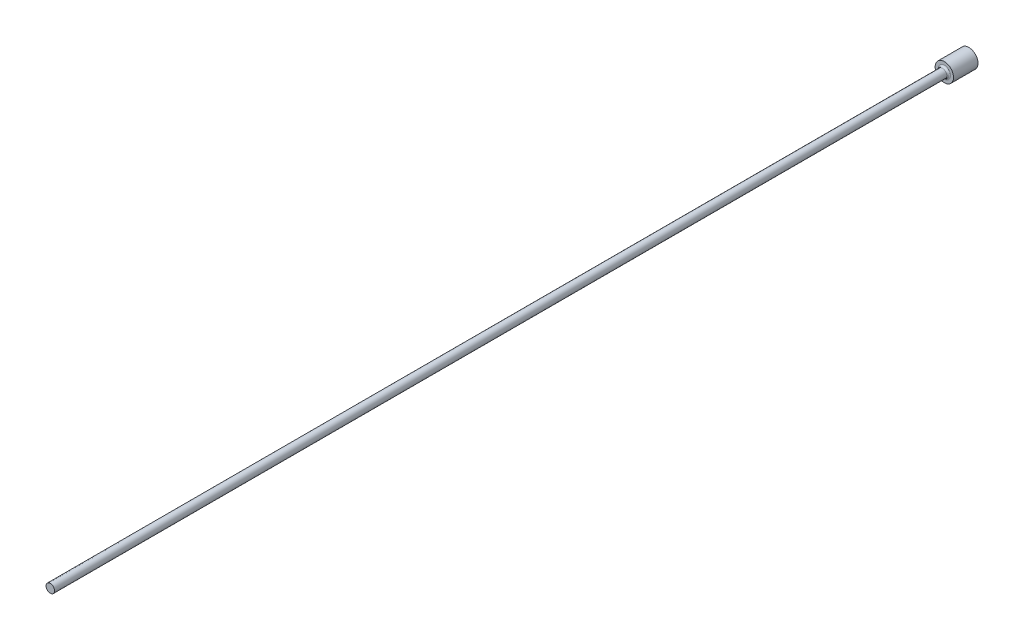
ISO-10303-21;
HEADER;
FILE_DESCRIPTION(('STEP AP214'),'2;1');
FILE_NAME('part.step','',(''),(''),'','','');
FILE_SCHEMA(('AUTOMOTIVE_DESIGN { 1 0 10303 214 1 1 1 1 }'));
ENDSEC;
DATA;
#1=APPLICATION_CONTEXT('core data for automotive mechanical design processes');
#2=APPLICATION_PROTOCOL_DEFINITION('international standard','automotive_design',2000,#1);
#3=PRODUCT_CONTEXT('',#1,'mechanical');
#4=PRODUCT('Part','Part','',(#3));
#5=PRODUCT_RELATED_PRODUCT_CATEGORY('part','',(#4));
#6=PRODUCT_DEFINITION_FORMATION('','',#4);
#7=PRODUCT_DEFINITION_CONTEXT('part definition',#1,'design');
#8=PRODUCT_DEFINITION('design','',#6,#7);
#9=PRODUCT_DEFINITION_SHAPE('','',#8);
#10=(LENGTH_UNIT() NAMED_UNIT(*) SI_UNIT(.MILLI.,.METRE.));
#11=(NAMED_UNIT(*) PLANE_ANGLE_UNIT() SI_UNIT($,.RADIAN.));
#12=(NAMED_UNIT(*) SI_UNIT($,.STERADIAN.) SOLID_ANGLE_UNIT());
#13=UNCERTAINTY_MEASURE_WITH_UNIT(LENGTH_MEASURE(1.E-05),#10,'distance_accuracy_value','');
#14=(GEOMETRIC_REPRESENTATION_CONTEXT(3) GLOBAL_UNCERTAINTY_ASSIGNED_CONTEXT((#13)) GLOBAL_UNIT_ASSIGNED_CONTEXT((#10,
#11,#12)) REPRESENTATION_CONTEXT('',''));
#15=CARTESIAN_POINT('',(0.,0.,0.));
#16=DIRECTION('',(0.,0.,1.));
#17=DIRECTION('',(1.,0.,0.));
#18=AXIS2_PLACEMENT_3D('',#15,#16,#17);
#19=CARTESIAN_POINT('',(1.5,0.,4.));
#20=DIRECTION('',(0.,0.,-1.));
#21=DIRECTION('',(-1.,0.,0.));
#22=AXIS2_PLACEMENT_3D('',#19,#20,#21);
#23=PLANE('',#22);
#24=CARTESIAN_POINT('',(0.,0.,4.));
#25=DIRECTION('',(0.,0.,-1.));
#26=DIRECTION('',(-1.,0.,0.));
#27=AXIS2_PLACEMENT_3D('',#24,#25,#26);
#28=CIRCLE('',#27,1.00000000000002);
#29=CARTESIAN_POINT('',(-1.00000000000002,0.,4.));
#30=VERTEX_POINT('',#29);
#31=EDGE_CURVE('E40',#30,#30,#28,.T.);
#32=ORIENTED_EDGE('',*,*,#31,.T.);
#33=EDGE_LOOP('',(#32));
#34=FACE_BOUND('',#33,.T.);
#35=CARTESIAN_POINT('',(0.,0.,4.));
#36=DIRECTION('',(0.,0.,-1.));
#37=DIRECTION('',(-1.,0.,0.));
#38=AXIS2_PLACEMENT_3D('',#35,#36,#37);
#39=CIRCLE('',#38,1.5);
#40=CARTESIAN_POINT('',(-1.5,0.,4.));
#41=VERTEX_POINT('',#40);
#42=EDGE_CURVE('E44',#41,#41,#39,.T.);
#43=ORIENTED_EDGE('',*,*,#42,.F.);
#44=EDGE_LOOP('',(#43));
#45=FACE_BOUND('',#44,.T.);
#46=ADVANCED_FACE('F33',(#34,#45),#23,.F.);
#47=CARTESIAN_POINT('',(0.,0.,-9.03322817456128));
#48=DIRECTION('',(0.,0.,-1.));
#49=DIRECTION('',(-1.,0.,0.));
#50=AXIS2_PLACEMENT_3D('',#47,#48,#49);
#51=CYLINDRICAL_SURFACE('',#50,1.5);
#52=CARTESIAN_POINT('',(0.,0.,0.));
#53=DIRECTION('',(0.,0.,-1.));
#54=DIRECTION('',(-1.,0.,0.));
#55=AXIS2_PLACEMENT_3D('',#52,#53,#54);
#56=CIRCLE('',#55,1.5);
#57=CARTESIAN_POINT('',(-1.5,0.,0.));
#58=VERTEX_POINT('',#57);
#59=EDGE_CURVE('E48',#58,#58,#56,.T.);
#60=ORIENTED_EDGE('',*,*,#59,.F.);
#61=EDGE_LOOP('',(#60));
#62=FACE_BOUND('',#61,.T.);
#63=ORIENTED_EDGE('',*,*,#42,.T.);
#64=EDGE_LOOP('',(#63));
#65=FACE_BOUND('',#64,.T.);
#66=ADVANCED_FACE('F68',(#62,#65),#51,.T.);
#67=CARTESIAN_POINT('',(0.,0.,0.));
#68=DIRECTION('',(0.,0.,1.));
#69=DIRECTION('',(1.,0.,0.));
#70=AXIS2_PLACEMENT_3D('',#67,#68,#69);
#71=PLANE('',#70);
#72=ORIENTED_EDGE('',*,*,#59,.T.);
#73=EDGE_LOOP('',(#72));
#74=FACE_BOUND('',#73,.T.);
#75=ADVANCED_FACE('F61',(#74),#71,.F.);
#76=CARTESIAN_POINT('',(0.,0.,150.));
#77=DIRECTION('',(0.,0.,-1.));
#78=DIRECTION('',(-1.,0.,0.));
#79=AXIS2_PLACEMENT_3D('',#76,#77,#78);
#80=PLANE('',#79);
#81=CARTESIAN_POINT('',(0.,0.,150.));
#82=DIRECTION('',(0.,0.,-1.));
#83=DIRECTION('',(-1.,0.,0.));
#84=AXIS2_PLACEMENT_3D('',#81,#82,#83);
#85=CIRCLE('',#84,0.70000000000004);
#86=CARTESIAN_POINT('',(-0.700000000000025,0.,150.));
#87=VERTEX_POINT('',#86);
#88=EDGE_CURVE('E53',#87,#87,#85,.T.);
#89=ORIENTED_EDGE('',*,*,#88,.F.);
#90=EDGE_LOOP('',(#89));
#91=FACE_BOUND('',#90,.T.);
#92=ADVANCED_FACE('F59',(#91),#80,.F.);
#93=CARTESIAN_POINT('',(0.,0.,-9.03322817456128));
#94=DIRECTION('',(0.,0.,-1.));
#95=DIRECTION('',(-1.,0.,0.));
#96=AXIS2_PLACEMENT_3D('',#93,#94,#95);
#97=CYLINDRICAL_SURFACE('',#96,0.70000000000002);
#98=CARTESIAN_POINT('',(0.,0.,4.3));
#99=DIRECTION('',(0.,0.,-1.));
#100=DIRECTION('',(-1.,0.,0.));
#101=AXIS2_PLACEMENT_3D('',#98,#99,#100);
#102=CIRCLE('',#101,0.70000000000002);
#103=CARTESIAN_POINT('',(-0.700000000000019,0.,4.3));
#104=VERTEX_POINT('',#103);
#105=EDGE_CURVE('E10',#104,#104,#102,.F.);
#106=ORIENTED_EDGE('',*,*,#105,.T.);
#107=EDGE_LOOP('',(#106));
#108=FACE_BOUND('',#107,.T.);
#109=ORIENTED_EDGE('',*,*,#88,.T.);
#110=EDGE_LOOP('',(#109));
#111=FACE_BOUND('',#110,.T.);
#112=ADVANCED_FACE('F57',(#108,#111),#97,.T.);
#113=CARTESIAN_POINT('',(0.,0.,4.3));
#114=DIRECTION('',(0.,0.,-1.));
#115=DIRECTION('',(-1.,0.,0.));
#116=AXIS2_PLACEMENT_3D('',#113,#114,#115);
#117=TOROIDAL_SURFACE('',#116,1.00000000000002,0.3);
#118=ORIENTED_EDGE('',*,*,#105,.F.);
#119=EDGE_LOOP('',(#118));
#120=FACE_BOUND('',#119,.T.);
#121=ORIENTED_EDGE('',*,*,#31,.F.);
#122=EDGE_LOOP('',(#121));
#123=FACE_BOUND('',#122,.T.);
#124=ADVANCED_FACE('F35',(#120,#123),#117,.F.);
#125=CLOSED_SHELL('',(#46,#66,#75,#92,#112,#124));
#126=MANIFOLD_SOLID_BREP('B2',#125);
#127=ADVANCED_BREP_SHAPE_REPRESENTATION('',(#18,#126),#14);
#128=SHAPE_DEFINITION_REPRESENTATION(#9,#127);
ENDSEC;
END-ISO-10303-21;
